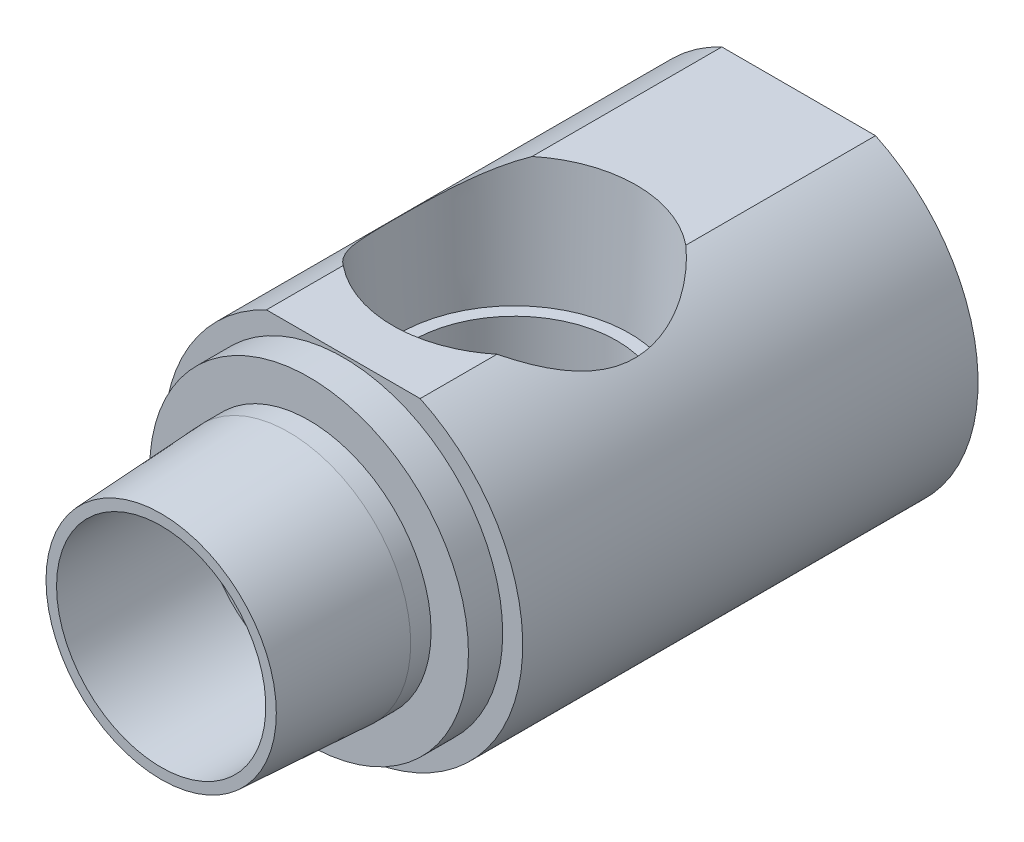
ISO-10303-21;
HEADER;
FILE_DESCRIPTION(('STEP AP214'),'2;1');
FILE_NAME('part.step','',(''),(''),'','','');
FILE_SCHEMA(('AUTOMOTIVE_DESIGN { 1 0 10303 214 1 1 1 1 }'));
ENDSEC;
DATA;
#1=APPLICATION_CONTEXT('core data for automotive mechanical design processes');
#2=APPLICATION_PROTOCOL_DEFINITION('international standard','automotive_design',2000,#1);
#3=PRODUCT_CONTEXT('',#1,'mechanical');
#4=PRODUCT('Part','Part','',(#3));
#5=PRODUCT_RELATED_PRODUCT_CATEGORY('part','',(#4));
#6=PRODUCT_DEFINITION_FORMATION('','',#4);
#7=PRODUCT_DEFINITION_CONTEXT('part definition',#1,'design');
#8=PRODUCT_DEFINITION('design','',#6,#7);
#9=PRODUCT_DEFINITION_SHAPE('','',#8);
#10=(LENGTH_UNIT() NAMED_UNIT(*) SI_UNIT(.MILLI.,.METRE.));
#11=(NAMED_UNIT(*) PLANE_ANGLE_UNIT() SI_UNIT($,.RADIAN.));
#12=(NAMED_UNIT(*) SI_UNIT($,.STERADIAN.) SOLID_ANGLE_UNIT());
#13=UNCERTAINTY_MEASURE_WITH_UNIT(LENGTH_MEASURE(1.E-05),#10,'distance_accuracy_value','');
#14=(GEOMETRIC_REPRESENTATION_CONTEXT(3) GLOBAL_UNCERTAINTY_ASSIGNED_CONTEXT((#13)) GLOBAL_UNIT_ASSIGNED_CONTEXT((#10,
#11,#12)) REPRESENTATION_CONTEXT('',''));
#15=CARTESIAN_POINT('',(0.,0.,0.));
#16=DIRECTION('',(0.,0.,1.));
#17=DIRECTION('',(1.,0.,0.));
#18=AXIS2_PLACEMENT_3D('',#15,#16,#17);
#19=CARTESIAN_POINT('',(-5.3594,11.3032925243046,0.));
#20=DIRECTION('',(0.,-1.,0.));
#21=DIRECTION('',(0.,0.,-1.));
#22=AXIS2_PLACEMENT_3D('',#19,#20,#21);
#23=PLANE('',#22);
#24=DIRECTION('',(0.,0.,-1.));
#25=VECTOR('',#24,1.);
#26=CARTESIAN_POINT('',(5.3594,11.3032925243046,0.));
#27=LINE('',#26,#25);
#28=CARTESIAN_POINT('',(5.3594,11.3032925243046,-12.7));
#29=VERTEX_POINT('',#28);
#30=CARTESIAN_POINT('',(5.3594,11.3032925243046,-18.05323946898));
#31=VERTEX_POINT('',#30);
#32=EDGE_CURVE('E142',#29,#31,#27,.T.);
#33=ORIENTED_EDGE('',*,*,#32,.T.);
#34=CARTESIAN_POINT('',(0.,11.3032925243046,-24.638));
#35=DIRECTION('',(0.,-1.,0.));
#36=DIRECTION('',(0.,0.,-1.));
#37=AXIS2_PLACEMENT_3D('',#34,#35,#36);
#38=CIRCLE('',#37,8.49012600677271);
#39=CARTESIAN_POINT('',(-5.3594,11.3032925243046,-18.05323946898));
#40=VERTEX_POINT('',#39);
#41=EDGE_CURVE('E128',#31,#40,#38,.T.);
#42=ORIENTED_EDGE('',*,*,#41,.T.);
#43=DIRECTION('',(0.,0.,-1.));
#44=VECTOR('',#43,1.);
#45=CARTESIAN_POINT('',(-5.3594,11.3032925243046,0.));
#46=LINE('',#45,#44);
#47=CARTESIAN_POINT('',(-5.3594,11.3032925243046,-12.7));
#48=VERTEX_POINT('',#47);
#49=EDGE_CURVE('E152',#48,#40,#46,.T.);
#50=ORIENTED_EDGE('',*,*,#49,.F.);
#51=DIRECTION('',(1.,0.,0.));
#52=VECTOR('',#51,1.);
#53=CARTESIAN_POINT('',(-11.1125,11.3032925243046,-12.7));
#54=LINE('',#53,#52);
#55=EDGE_CURVE('E149',#48,#29,#54,.T.);
#56=ORIENTED_EDGE('',*,*,#55,.T.);
#57=EDGE_LOOP('',(#33,#42,#50,#56));
#58=FACE_BOUND('',#57,.T.);
#59=ADVANCED_FACE('F16',(#58),#23,.F.);
#60=CARTESIAN_POINT('',(0.,0.,-75.1971669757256));
#61=DIRECTION('',(0.,0.,-1.));
#62=DIRECTION('',(-1.,0.,0.));
#63=AXIS2_PLACEMENT_3D('',#60,#61,#62);
#64=CYLINDRICAL_SURFACE('',#63,7.29488);
#65=CARTESIAN_POINT('',(0.,0.,0.));
#66=DIRECTION('',(0.,0.,-1.));
#67=DIRECTION('',(-1.,0.,0.));
#68=AXIS2_PLACEMENT_3D('',#65,#66,#67);
#69=CIRCLE('',#68,7.29488);
#70=CARTESIAN_POINT('',(-7.29488,0.,0.));
#71=VERTEX_POINT('',#70);
#72=EDGE_CURVE('E177',#71,#71,#69,.T.);
#73=ORIENTED_EDGE('',*,*,#72,.F.);
#74=EDGE_LOOP('',(#73));
#75=FACE_BOUND('',#74,.T.);
#76=CARTESIAN_POINT('',(0.,0.,-10.16));
#77=DIRECTION('',(0.,0.,-1.));
#78=DIRECTION('',(-1.,0.,0.));
#79=AXIS2_PLACEMENT_3D('',#76,#77,#78);
#80=CIRCLE('',#79,7.29488);
#81=CARTESIAN_POINT('',(-2.83926860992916,-6.71965981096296,-10.16));
#82=VERTEX_POINT('',#81);
#83=CARTESIAN_POINT('',(2.83926860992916,-6.71965981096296,-10.16));
#84=VERTEX_POINT('',#83);
#85=EDGE_CURVE('E174',#82,#84,#80,.T.);
#86=ORIENTED_EDGE('',*,*,#85,.T.);
#87=CARTESIAN_POINT('',(2.83926860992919,-6.71965981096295,-10.16));
#88=CARTESIAN_POINT('',(2.70908587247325,-6.77470567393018,-10.1020217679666));
#89=CARTESIAN_POINT('',(2.5754535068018,-6.82667201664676,-10.0489157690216));
#90=CARTESIAN_POINT('',(2.30236644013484,-6.92352687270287,-9.95216490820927));
#91=CARTESIAN_POINT('',(2.16291320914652,-6.96841715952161,-9.90851767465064));
#92=CARTESIAN_POINT('',(1.87942013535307,-7.05016472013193,-9.83043423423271));
#93=CARTESIAN_POINT('',(1.73538792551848,-7.08703463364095,-9.79598351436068));
#94=CARTESIAN_POINT('',(1.44358277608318,-7.15218030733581,-9.73591827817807));
#95=CARTESIAN_POINT('',(1.2958096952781,-7.18045574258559,-9.71030409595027));
#96=CARTESIAN_POINT('',(0.997667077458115,-7.22791200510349,-9.66769273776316));
#97=CARTESIAN_POINT('',(0.847298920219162,-7.2470975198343,-9.65069112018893));
#98=CARTESIAN_POINT('',(0.544945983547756,-7.27608226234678,-9.62512012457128));
#99=CARTESIAN_POINT('',(0.392961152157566,-7.28588118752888,-9.61655101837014));
#100=CARTESIAN_POINT('',(0.0883390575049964,-7.29593786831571,-9.60775748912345));
#101=CARTESIAN_POINT('',(-0.0642985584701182,-7.29618956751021,-9.60753836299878));
#102=CARTESIAN_POINT('',(-0.369068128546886,-7.28713276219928,-9.61545583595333));
#103=CARTESIAN_POINT('',(-0.521200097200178,-7.27782453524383,-9.62359219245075));
#104=CARTESIAN_POINT('',(-0.825795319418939,-7.24962203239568,-9.6484560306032));
#105=CARTESIAN_POINT('',(-0.978239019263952,-7.23060958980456,-9.66528944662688));
#106=CARTESIAN_POINT('',(-1.28042184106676,-7.18325692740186,-9.70777205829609));
#107=CARTESIAN_POINT('',(-1.43016107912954,-7.15491710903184,-9.73342087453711));
#108=CARTESIAN_POINT('',(-1.72558403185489,-7.08946317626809,-9.79372044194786));
#109=CARTESIAN_POINT('',(-1.87127414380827,-7.05236389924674,-9.82835598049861));
#110=CARTESIAN_POINT('',(-2.15770494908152,-6.97006186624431,-9.90692525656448));
#111=CARTESIAN_POINT('',(-2.29844851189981,-6.92486390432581,-9.95085349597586));
#112=CARTESIAN_POINT('',(-2.50498218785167,-6.85169148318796,-10.023911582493));
#113=CARTESIAN_POINT('',(-2.57303323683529,-6.8264174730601,-10.049445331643));
#114=CARTESIAN_POINT('',(-2.7074313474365,-6.77423657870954,-10.1029103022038));
#115=CARTESIAN_POINT('',(-2.77378053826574,-6.74733189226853,-10.1308383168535));
#116=CARTESIAN_POINT('',(-2.83926860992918,-6.7196598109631,-10.1600000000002));
#117=B_SPLINE_CURVE_WITH_KNOTS('',3,(#87,#88,#89,#90,#91,#92,#93,#94,#95,#96,#97,#98,#99,#100,
#101,#102,#103,#104,#105,#106,#107,#108,#109,#110,#111,#112,#113,#114,#115,#116),.UNSPECIFIED.,
.F.,.F.,(4,2,2,2,2,2,2,2,2,2,2,2,2,2,4),(0.,0.458141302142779,0.916167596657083,
1.37346674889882,1.83078318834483,2.28786354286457,2.74495863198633,3.20234368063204,
3.65971545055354,4.12279436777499,4.58585335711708,5.04813354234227,5.51014097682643,
5.74093493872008,5.9714244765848),.UNSPECIFIED.);
#118=EDGE_CURVE('E238',#84,#82,#117,.T.);
#119=ORIENTED_EDGE('',*,*,#118,.T.);
#120=EDGE_LOOP('',(#86,#119));
#121=FACE_BOUND('',#120,.T.);
#122=ADVANCED_FACE('F232',(#75,#121),#64,.F.);
#123=CARTESIAN_POINT('',(-7.29488,0.,-10.16));
#124=DIRECTION('',(0.,0.,1.));
#125=DIRECTION('',(1.,0.,0.));
#126=AXIS2_PLACEMENT_3D('',#123,#124,#125);
#127=PLANE('',#126);
#128=ORIENTED_EDGE('',*,*,#85,.F.);
#129=CARTESIAN_POINT('',(0.,-0.996470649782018,-10.16));
#130=DIRECTION('',(0.,0.,1.));
#131=DIRECTION('',(0.,-1.,0.));
#132=AXIS2_PLACEMENT_3D('',#129,#130,#131);
#133=ELLIPSE('',#132,6.41876281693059,6.27107494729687);
#134=EDGE_CURVE('E184',#82,#84,#133,.F.);
#135=ORIENTED_EDGE('',*,*,#134,.T.);
#136=EDGE_LOOP('',(#128,#135));
#137=FACE_BOUND('',#136,.T.);
#138=ADVANCED_FACE('F229',(#137),#127,.T.);
#139=CARTESIAN_POINT('',(0.,0.,-8.89));
#140=DIRECTION('',(0.,0.,-1.));
#141=DIRECTION('',(-1.,0.,0.));
#142=AXIS2_PLACEMENT_3D('',#139,#140,#141);
#143=CONICAL_SURFACE('',#142,8.509,0.0538619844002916);
#144=CARTESIAN_POINT('',(0.,0.,0.));
#145=DIRECTION('',(0.,0.,-1.));
#146=DIRECTION('',(-1.,0.,0.));
#147=AXIS2_PLACEMENT_3D('',#144,#145,#146);
#148=CIRCLE('',#147,8.02970337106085);
#149=CARTESIAN_POINT('',(-8.02970337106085,0.,0.));
#150=VERTEX_POINT('',#149);
#151=EDGE_CURVE('E180',#150,#150,#148,.T.);
#152=ORIENTED_EDGE('',*,*,#151,.T.);
#153=EDGE_LOOP('',(#152));
#154=FACE_BOUND('',#153,.T.);
#155=CARTESIAN_POINT('',(0.,0.,-8.89));
#156=DIRECTION('',(0.,0.,-1.));
#157=DIRECTION('',(-1.,0.,0.));
#158=AXIS2_PLACEMENT_3D('',#155,#156,#157);
#159=CIRCLE('',#158,8.509);
#160=CARTESIAN_POINT('',(-8.509,0.,-8.89));
#161=VERTEX_POINT('',#160);
#162=EDGE_CURVE('E157',#161,#161,#159,.T.);
#163=ORIENTED_EDGE('',*,*,#162,.F.);
#164=EDGE_LOOP('',(#163));
#165=FACE_BOUND('',#164,.T.);
#166=ADVANCED_FACE('F18',(#154,#165),#143,.T.);
#167=CARTESIAN_POINT('',(-7.29488,0.,0.));
#168=DIRECTION('',(0.,0.,1.));
#169=DIRECTION('',(1.,0.,0.));
#170=AXIS2_PLACEMENT_3D('',#167,#168,#169);
#171=PLANE('',#170);
#172=ORIENTED_EDGE('',*,*,#72,.T.);
#173=EDGE_LOOP('',(#172));
#174=FACE_BOUND('',#173,.T.);
#175=ORIENTED_EDGE('',*,*,#151,.F.);
#176=EDGE_LOOP('',(#175));
#177=FACE_BOUND('',#176,.T.);
#178=ADVANCED_FACE('F227',(#174,#177),#171,.T.);
#179=CARTESIAN_POINT('',(-12.5095,0.,-44.45));
#180=DIRECTION('',(0.,0.,-1.));
#181=DIRECTION('',(-1.,0.,0.));
#182=AXIS2_PLACEMENT_3D('',#179,#180,#181);
#183=PLANE('',#182);
#184=DIRECTION('',(1.,0.,0.));
#185=VECTOR('',#184,1.);
#186=CARTESIAN_POINT('',(-3.66617420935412,6.35,-44.45));
#187=LINE('',#186,#185);
#188=CARTESIAN_POINT('',(-3.66617420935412,6.35,-44.45));
#189=VERTEX_POINT('',#188);
#190=CARTESIAN_POINT('',(3.66617420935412,6.35,-44.45));
#191=VERTEX_POINT('',#190);
#192=EDGE_CURVE('E245',#189,#191,#187,.T.);
#193=ORIENTED_EDGE('',*,*,#192,.F.);
#194=DIRECTION('',(0.5,0.866025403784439,0.));
#195=VECTOR('',#194,1.);
#196=CARTESIAN_POINT('',(-7.33234841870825,0.,-44.45));
#197=LINE('',#196,#195);
#198=CARTESIAN_POINT('',(-7.33234841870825,0.,-44.45));
#199=VERTEX_POINT('',#198);
#200=EDGE_CURVE('E252',#199,#189,#197,.T.);
#201=ORIENTED_EDGE('',*,*,#200,.F.);
#202=DIRECTION('',(-0.5,0.866025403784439,0.));
#203=VECTOR('',#202,1.);
#204=CARTESIAN_POINT('',(-3.66617420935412,-6.35,-44.45));
#205=LINE('',#204,#203);
#206=CARTESIAN_POINT('',(-3.66617420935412,-6.35,-44.45));
#207=VERTEX_POINT('',#206);
#208=EDGE_CURVE('E278',#207,#199,#205,.T.);
#209=ORIENTED_EDGE('',*,*,#208,.F.);
#210=DIRECTION('',(-1.,0.,0.));
#211=VECTOR('',#210,1.);
#212=CARTESIAN_POINT('',(3.66617420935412,-6.35,-44.45));
#213=LINE('',#212,#211);
#214=CARTESIAN_POINT('',(3.66617420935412,-6.35,-44.45));
#215=VERTEX_POINT('',#214);
#216=EDGE_CURVE('E275',#215,#207,#213,.T.);
#217=ORIENTED_EDGE('',*,*,#216,.F.);
#218=DIRECTION('',(-0.5,-0.866025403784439,0.));
#219=VECTOR('',#218,1.);
#220=CARTESIAN_POINT('',(7.33234841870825,0.,-44.45));
#221=LINE('',#220,#219);
#222=CARTESIAN_POINT('',(7.33234841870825,0.,-44.45));
#223=VERTEX_POINT('',#222);
#224=EDGE_CURVE('E272',#223,#215,#221,.T.);
#225=ORIENTED_EDGE('',*,*,#224,.F.);
#226=DIRECTION('',(0.5,-0.866025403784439,0.));
#227=VECTOR('',#226,1.);
#228=CARTESIAN_POINT('',(3.66617420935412,6.35,-44.45));
#229=LINE('',#228,#227);
#230=EDGE_CURVE('E269',#191,#223,#229,.T.);
#231=ORIENTED_EDGE('',*,*,#230,.F.);
#232=EDGE_LOOP('',(#193,#201,#209,#217,#225,#231));
#233=FACE_BOUND('',#232,.T.);
#234=DIRECTION('',(-1.,0.,0.));
#235=VECTOR('',#234,1.);
#236=CARTESIAN_POINT('',(-5.3594,11.3032925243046,-44.45));
#237=LINE('',#236,#235);
#238=CARTESIAN_POINT('',(5.3594,11.3032925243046,-44.45));
#239=VERTEX_POINT('',#238);
#240=CARTESIAN_POINT('',(-5.3594,11.3032925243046,-44.45));
#241=VERTEX_POINT('',#240);
#242=EDGE_CURVE('E154',#239,#241,#237,.T.);
#243=ORIENTED_EDGE('',*,*,#242,.F.);
#244=CARTESIAN_POINT('',(0.,0.,-44.45));
#245=DIRECTION('',(0.,0.,-1.));
#246=DIRECTION('',(-1.,0.,0.));
#247=AXIS2_PLACEMENT_3D('',#244,#245,#246);
#248=CIRCLE('',#247,12.5095);
#249=EDGE_CURVE('E171',#239,#241,#248,.T.);
#250=ORIENTED_EDGE('',*,*,#249,.T.);
#251=EDGE_LOOP('',(#243,#250));
#252=FACE_BOUND('',#251,.T.);
#253=ADVANCED_FACE('F222',(#233,#252),#183,.T.);
#254=CARTESIAN_POINT('',(0.,0.,-75.1971669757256));
#255=DIRECTION('',(0.,0.,-1.));
#256=DIRECTION('',(-1.,0.,0.));
#257=AXIS2_PLACEMENT_3D('',#254,#255,#256);
#258=CYLINDRICAL_SURFACE('',#257,12.5095);
#259=CARTESIAN_POINT('',(5.3589781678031,11.3034925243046,-18.0528826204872));
#260=CARTESIAN_POINT('',(5.54921369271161,11.2133234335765,-18.2138407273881));
#261=CARTESIAN_POINT('',(5.73165431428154,11.1209258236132,-18.382665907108));
#262=CARTESIAN_POINT('',(6.08048620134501,10.9340894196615,-18.7352208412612));
#263=CARTESIAN_POINT('',(6.24687354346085,10.8396501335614,-18.9189542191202));
#264=CARTESIAN_POINT('',(6.56420314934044,10.6505028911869,-19.3018126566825));
#265=CARTESIAN_POINT('',(6.71502345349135,10.5557980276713,-19.5010405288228));
#266=CARTESIAN_POINT('',(6.99914257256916,10.3695935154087,-19.9128637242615));
#267=CARTESIAN_POINT('',(7.1324444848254,10.2780933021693,-20.1254566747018));
#268=CARTESIAN_POINT('',(7.46650834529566,10.0401700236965,-20.7146742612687));
#269=CARTESIAN_POINT('',(7.65054804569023,9.89929381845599,-21.1034819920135));
#270=CARTESIAN_POINT('',(7.88323238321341,9.71350267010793,-21.7099632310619));
#271=CARTESIAN_POINT('',(7.95350713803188,9.65587918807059,-21.9157452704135));
#272=CARTESIAN_POINT('',(8.07900681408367,9.55112103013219,-22.3345154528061));
#273=CARTESIAN_POINT('',(8.1342346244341,9.50398434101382,-22.5475022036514));
#274=CARTESIAN_POINT('',(8.22106638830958,9.42891275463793,-22.944107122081));
#275=CARTESIAN_POINT('',(8.25505388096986,9.39910020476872,-23.1268521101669));
#276=CARTESIAN_POINT('',(8.31144289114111,9.34927427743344,-23.4954304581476));
#277=CARTESIAN_POINT('',(8.33384667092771,9.32925898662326,-23.6812632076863));
#278=CARTESIAN_POINT('',(8.36672861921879,9.29978140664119,-24.0547275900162));
#279=CARTESIAN_POINT('',(8.37721265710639,9.29031392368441,-24.2423582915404));
#280=CARTESIAN_POINT('',(8.3861052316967,9.28228778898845,-24.6181465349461));
#281=CARTESIAN_POINT('',(8.38451351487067,9.28372936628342,-24.8063040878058));
#282=CARTESIAN_POINT('',(8.36928475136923,9.29746017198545,-25.1816139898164));
#283=CARTESIAN_POINT('',(8.35565497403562,9.30974285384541,-25.3687668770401));
#284=CARTESIAN_POINT('',(8.3165791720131,9.3446659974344,-25.7408437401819));
#285=CARTESIAN_POINT('',(8.2911332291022,9.36730638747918,-25.925767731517));
#286=CARTESIAN_POINT('',(8.22876601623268,9.42213985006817,-26.292394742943));
#287=CARTESIAN_POINT('',(8.19183425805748,9.45434165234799,-26.4740946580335));
#288=CARTESIAN_POINT('',(8.10694730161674,9.52723048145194,-26.8332473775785));
#289=CARTESIAN_POINT('',(8.0589858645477,9.56792230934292,-27.0106977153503));
#290=CARTESIAN_POINT('',(7.93720028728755,9.66935365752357,-27.4109579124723));
#291=CARTESIAN_POINT('',(7.85990590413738,9.73249157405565,-27.6321095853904));
#292=CARTESIAN_POINT('',(7.68886075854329,9.86817719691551,-28.0649768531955));
#293=CARTESIAN_POINT('',(7.59510436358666,9.940728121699,-28.2766891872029));
#294=CARTESIAN_POINT('',(7.39186656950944,10.092770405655,-28.6902308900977));
#295=CARTESIAN_POINT('',(7.28236248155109,10.172271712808,-28.8920454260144));
#296=CARTESIAN_POINT('',(7.04849385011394,10.3357003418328,-29.2848508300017));
#297=CARTESIAN_POINT('',(6.92413202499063,10.4196268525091,-29.4758436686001));
#298=CARTESIAN_POINT('',(6.58695562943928,10.637641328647,-29.9510218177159));
#299=CARTESIAN_POINT('',(6.36373226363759,10.7733928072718,-30.2272036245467));
#300=CARTESIAN_POINT('',(6.00459360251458,10.9750283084,-30.6184604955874));
#301=CARTESIAN_POINT('',(5.88113847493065,11.0417585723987,-30.7447819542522));
#302=CARTESIAN_POINT('',(5.62611191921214,11.1738564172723,-30.9897690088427));
#303=CARTESIAN_POINT('',(5.49453878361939,11.2392237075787,-31.1084329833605));
#304=CARTESIAN_POINT('',(5.3589781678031,11.3034925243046,-31.2231173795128));
#305=B_SPLINE_CURVE_WITH_KNOTS('',3,(#259,#260,#261,#262,#263,#264,#265,#266,#267,#268,#269,
#270,#271,#272,#273,#274,#275,#276,#277,#278,#279,#280,#281,#282,#283,#284,#285,#286,#287,#288,
#289,#290,#291,#292,#293,#294,#295,#296,#297,#298,#299,#300,#301,#302,#303,#304),.UNSPECIFIED.,
.F.,.F.,(4,2,2,2,2,2,2,2,2,2,2,2,2,2,2,2,2,2,2,2,2,2,4),(0.,0.79468460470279,1.58956293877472,
2.39025916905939,3.19081364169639,4.54240556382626,5.21661127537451,5.89068744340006,
6.45486541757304,7.01893316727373,7.58272304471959,8.14652475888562,8.70998624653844,
9.27344383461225,9.83741745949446,10.4017108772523,11.1285534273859,11.8556451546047,
12.5837951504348,13.3118121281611,14.4492964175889,15.0154674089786,15.5817578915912),.UNSPECIFIED.);
#306=CARTESIAN_POINT('',(5.3594,11.3032925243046,-31.2227605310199));
#307=VERTEX_POINT('',#306);
#308=EDGE_CURVE('E36',#31,#307,#305,.T.);
#309=ORIENTED_EDGE('',*,*,#308,.F.);
#310=ORIENTED_EDGE('',*,*,#32,.F.);
#311=CARTESIAN_POINT('',(0.,0.,-12.7));
#312=DIRECTION('',(0.,0.,-1.));
#313=DIRECTION('',(-1.,0.,0.));
#314=AXIS2_PLACEMENT_3D('',#311,#312,#313);
#315=CIRCLE('',#314,12.5095);
#316=EDGE_CURVE('E169',#29,#48,#315,.T.);
#317=ORIENTED_EDGE('',*,*,#316,.T.);
#318=ORIENTED_EDGE('',*,*,#49,.T.);
#319=CARTESIAN_POINT('',(-5.3589781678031,11.3034925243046,-31.2231173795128));
#320=CARTESIAN_POINT('',(-5.54921369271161,11.2133234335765,-31.0621592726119));
#321=CARTESIAN_POINT('',(-5.73165431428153,11.1209258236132,-30.893334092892));
#322=CARTESIAN_POINT('',(-6.08048620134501,10.9340894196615,-30.5407791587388));
#323=CARTESIAN_POINT('',(-6.24687354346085,10.8396501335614,-30.3570457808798));
#324=CARTESIAN_POINT('',(-6.56420314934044,10.6505028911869,-29.9741873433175));
#325=CARTESIAN_POINT('',(-6.71502345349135,10.5557980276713,-29.7749594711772));
#326=CARTESIAN_POINT('',(-6.99914257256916,10.3695935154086,-29.3631362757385));
#327=CARTESIAN_POINT('',(-7.1324444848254,10.2780933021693,-29.1505433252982));
#328=CARTESIAN_POINT('',(-7.46650834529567,10.0401700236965,-28.5613257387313));
#329=CARTESIAN_POINT('',(-7.65054804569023,9.89929381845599,-28.1725180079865));
#330=CARTESIAN_POINT('',(-7.88323238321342,9.71350267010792,-27.5660367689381));
#331=CARTESIAN_POINT('',(-7.95350713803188,9.65587918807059,-27.3602547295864));
#332=CARTESIAN_POINT('',(-8.07900681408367,9.55112103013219,-26.9414845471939));
#333=CARTESIAN_POINT('',(-8.1342346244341,9.50398434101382,-26.7284977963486));
#334=CARTESIAN_POINT('',(-8.22106638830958,9.42891275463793,-26.331892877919));
#335=CARTESIAN_POINT('',(-8.25505388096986,9.39910020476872,-26.1491478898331));
#336=CARTESIAN_POINT('',(-8.31144289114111,9.34927427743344,-25.7805695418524));
#337=CARTESIAN_POINT('',(-8.33384667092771,9.32925898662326,-25.5947367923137));
#338=CARTESIAN_POINT('',(-8.36672861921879,9.29978140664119,-25.2212724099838));
#339=CARTESIAN_POINT('',(-8.37721265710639,9.29031392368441,-25.0336417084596));
#340=CARTESIAN_POINT('',(-8.3861052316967,9.28228778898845,-24.6578534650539));
#341=CARTESIAN_POINT('',(-8.38451351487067,9.28372936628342,-24.4696959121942));
#342=CARTESIAN_POINT('',(-8.36928475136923,9.29746017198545,-24.0943860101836));
#343=CARTESIAN_POINT('',(-8.35565497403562,9.30974285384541,-23.9072331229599));
#344=CARTESIAN_POINT('',(-8.3165791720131,9.3446659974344,-23.5351562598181));
#345=CARTESIAN_POINT('',(-8.2911332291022,9.36730638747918,-23.350232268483));
#346=CARTESIAN_POINT('',(-8.22876601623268,9.42213985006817,-22.983605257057));
#347=CARTESIAN_POINT('',(-8.19183425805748,9.45434165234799,-22.8019053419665));
#348=CARTESIAN_POINT('',(-8.10694730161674,9.52723048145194,-22.4427526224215));
#349=CARTESIAN_POINT('',(-8.0589858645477,9.56792230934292,-22.2653022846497));
#350=CARTESIAN_POINT('',(-7.93720028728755,9.66935365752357,-21.8650420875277));
#351=CARTESIAN_POINT('',(-7.85990590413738,9.73249157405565,-21.6438904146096));
#352=CARTESIAN_POINT('',(-7.68886075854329,9.86817719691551,-21.2110231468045));
#353=CARTESIAN_POINT('',(-7.59510436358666,9.940728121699,-20.9993108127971));
#354=CARTESIAN_POINT('',(-7.39186656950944,10.092770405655,-20.5857691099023));
#355=CARTESIAN_POINT('',(-7.28236248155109,10.172271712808,-20.3839545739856));
#356=CARTESIAN_POINT('',(-7.04849385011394,10.3357003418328,-19.9911491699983));
#357=CARTESIAN_POINT('',(-6.92413202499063,10.4196268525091,-19.8001563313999));
#358=CARTESIAN_POINT('',(-6.58695562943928,10.637641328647,-19.3249781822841));
#359=CARTESIAN_POINT('',(-6.36373226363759,10.7733928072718,-19.0487963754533));
#360=CARTESIAN_POINT('',(-6.00459360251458,10.9750283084,-18.6575395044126));
#361=CARTESIAN_POINT('',(-5.88113847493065,11.0417585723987,-18.5312180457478));
#362=CARTESIAN_POINT('',(-5.62611191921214,11.1738564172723,-18.2862309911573));
#363=CARTESIAN_POINT('',(-5.49453878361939,11.2392237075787,-18.1675670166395));
#364=CARTESIAN_POINT('',(-5.3589781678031,11.3034925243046,-18.0528826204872));
#365=B_SPLINE_CURVE_WITH_KNOTS('',3,(#319,#320,#321,#322,#323,#324,#325,#326,#327,#328,#329,
#330,#331,#332,#333,#334,#335,#336,#337,#338,#339,#340,#341,#342,#343,#344,#345,#346,#347,#348,
#349,#350,#351,#352,#353,#354,#355,#356,#357,#358,#359,#360,#361,#362,#363,#364),.UNSPECIFIED.,
.F.,.F.,(4,2,2,2,2,2,2,2,2,2,2,2,2,2,2,2,2,2,2,2,2,2,4),(0.,0.794684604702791,1.58956293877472,
2.39025916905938,3.19081364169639,4.54240556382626,5.21661127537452,5.89068744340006,
6.45486541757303,7.01893316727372,7.58272304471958,8.14652475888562,8.70998624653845,
9.27344383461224,9.83741745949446,10.4017108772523,11.1285534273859,11.8556451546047,
12.5837951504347,13.3118121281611,14.4492964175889,15.0154674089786,15.5817578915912),.UNSPECIFIED.);
#366=CARTESIAN_POINT('',(-5.3594,11.3032925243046,-31.2227605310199));
#367=VERTEX_POINT('',#366);
#368=EDGE_CURVE('E131',#367,#40,#365,.T.);
#369=ORIENTED_EDGE('',*,*,#368,.F.);
#370=EDGE_CURVE('E150',#367,#241,#46,.T.);
#371=ORIENTED_EDGE('',*,*,#370,.T.);
#372=ORIENTED_EDGE('',*,*,#249,.F.);
#373=EDGE_CURVE('E145',#307,#239,#27,.T.);
#374=ORIENTED_EDGE('',*,*,#373,.F.);
#375=EDGE_LOOP('',(#309,#310,#317,#318,#369,#371,#372,#374));
#376=FACE_BOUND('',#375,.T.);
#377=ADVANCED_FACE('F140',(#376),#258,.T.);
#378=CARTESIAN_POINT('',(-11.1125,0.,-12.7));
#379=DIRECTION('',(0.,0.,1.));
#380=DIRECTION('',(1.,0.,0.));
#381=AXIS2_PLACEMENT_3D('',#378,#379,#380);
#382=PLANE('',#381);
#383=ORIENTED_EDGE('',*,*,#55,.F.);
#384=ORIENTED_EDGE('',*,*,#316,.F.);
#385=EDGE_LOOP('',(#383,#384));
#386=FACE_BOUND('',#385,.T.);
#387=CARTESIAN_POINT('',(0.,0.,-12.7));
#388=DIRECTION('',(0.,0.,-1.));
#389=DIRECTION('',(-1.,0.,0.));
#390=AXIS2_PLACEMENT_3D('',#387,#388,#389);
#391=CIRCLE('',#390,11.1125);
#392=CARTESIAN_POINT('',(-11.1125,0.,-12.7));
#393=VERTEX_POINT('',#392);
#394=EDGE_CURVE('E166',#393,#393,#391,.T.);
#395=ORIENTED_EDGE('',*,*,#394,.T.);
#396=EDGE_LOOP('',(#395));
#397=FACE_BOUND('',#396,.T.);
#398=ADVANCED_FACE('F221',(#386,#397),#382,.T.);
#399=CARTESIAN_POINT('',(0.,0.,-75.1971669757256));
#400=DIRECTION('',(0.,0.,-1.));
#401=DIRECTION('',(-1.,0.,0.));
#402=AXIS2_PLACEMENT_3D('',#399,#400,#401);
#403=CYLINDRICAL_SURFACE('',#402,11.1125);
#404=CARTESIAN_POINT('',(0.,0.,-10.3124));
#405=DIRECTION('',(0.,0.,-1.));
#406=DIRECTION('',(-1.,0.,0.));
#407=AXIS2_PLACEMENT_3D('',#404,#405,#406);
#408=CIRCLE('',#407,11.1125);
#409=CARTESIAN_POINT('',(-11.1125,0.,-10.3124));
#410=VERTEX_POINT('',#409);
#411=EDGE_CURVE('E163',#410,#410,#408,.T.);
#412=ORIENTED_EDGE('',*,*,#411,.T.);
#413=EDGE_LOOP('',(#412));
#414=FACE_BOUND('',#413,.T.);
#415=ORIENTED_EDGE('',*,*,#394,.F.);
#416=EDGE_LOOP('',(#415));
#417=FACE_BOUND('',#416,.T.);
#418=ADVANCED_FACE('F303',(#414,#417),#403,.T.);
#419=CARTESIAN_POINT('',(-8.509,0.,-10.3124));
#420=DIRECTION('',(0.,0.,1.));
#421=DIRECTION('',(1.,0.,0.));
#422=AXIS2_PLACEMENT_3D('',#419,#420,#421);
#423=PLANE('',#422);
#424=CARTESIAN_POINT('',(0.,0.,-10.3124));
#425=DIRECTION('',(0.,0.,-1.));
#426=DIRECTION('',(-1.,0.,0.));
#427=AXIS2_PLACEMENT_3D('',#424,#425,#426);
#428=CIRCLE('',#427,8.509);
#429=CARTESIAN_POINT('',(-8.509,0.,-10.3124));
#430=VERTEX_POINT('',#429);
#431=EDGE_CURVE('E160',#430,#430,#428,.T.);
#432=ORIENTED_EDGE('',*,*,#431,.T.);
#433=EDGE_LOOP('',(#432));
#434=FACE_BOUND('',#433,.T.);
#435=ORIENTED_EDGE('',*,*,#411,.F.);
#436=EDGE_LOOP('',(#435));
#437=FACE_BOUND('',#436,.T.);
#438=ADVANCED_FACE('F307',(#434,#437),#423,.T.);
#439=CARTESIAN_POINT('',(0.,0.,-75.1971669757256));
#440=DIRECTION('',(0.,0.,-1.));
#441=DIRECTION('',(-1.,0.,0.));
#442=AXIS2_PLACEMENT_3D('',#439,#440,#441);
#443=CYLINDRICAL_SURFACE('',#442,8.509);
#444=ORIENTED_EDGE('',*,*,#162,.T.);
#445=EDGE_LOOP('',(#444));
#446=FACE_BOUND('',#445,.T.);
#447=ORIENTED_EDGE('',*,*,#431,.F.);
#448=EDGE_LOOP('',(#447));
#449=FACE_BOUND('',#448,.T.);
#450=ADVANCED_FACE('F314',(#446,#449),#443,.T.);
#451=ORIENTED_EDGE('',*,*,#370,.F.);
#452=EDGE_CURVE('E135',#367,#307,#38,.T.);
#453=ORIENTED_EDGE('',*,*,#452,.T.);
#454=ORIENTED_EDGE('',*,*,#373,.T.);
#455=ORIENTED_EDGE('',*,*,#242,.T.);
#456=EDGE_LOOP('',(#451,#453,#454,#455));
#457=FACE_BOUND('',#456,.T.);
#458=ADVANCED_FACE('F298',(#457),#23,.F.);
#459=CARTESIAN_POINT('',(-3.66617420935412,6.35,-38.1));
#460=DIRECTION('',(0.,1.,0.));
#461=DIRECTION('',(-1.,0.,0.));
#462=AXIS2_PLACEMENT_3D('',#459,#460,#461);
#463=PLANE('',#462);
#464=ORIENTED_EDGE('',*,*,#192,.T.);
#465=DIRECTION('',(0.,0.,-1.));
#466=VECTOR('',#465,1.);
#467=CARTESIAN_POINT('',(3.66617420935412,6.35,-38.1));
#468=LINE('',#467,#466);
#469=CARTESIAN_POINT('',(3.66617420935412,6.35,-38.1));
#470=VERTEX_POINT('',#469);
#471=EDGE_CURVE('E267',#470,#191,#468,.T.);
#472=ORIENTED_EDGE('',*,*,#471,.F.);
#473=DIRECTION('',(1.,0.,0.));
#474=VECTOR('',#473,1.);
#475=CARTESIAN_POINT('',(-3.66617420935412,6.35,-38.1));
#476=LINE('',#475,#474);
#477=CARTESIAN_POINT('',(-3.66617420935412,6.35,-38.1));
#478=VERTEX_POINT('',#477);
#479=EDGE_CURVE('E248',#478,#470,#476,.T.);
#480=ORIENTED_EDGE('',*,*,#479,.F.);
#481=DIRECTION('',(0.,0.,-1.));
#482=VECTOR('',#481,1.);
#483=CARTESIAN_POINT('',(-3.66617420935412,6.35,-38.1));
#484=LINE('',#483,#482);
#485=EDGE_CURVE('E283',#478,#189,#484,.T.);
#486=ORIENTED_EDGE('',*,*,#485,.T.);
#487=EDGE_LOOP('',(#464,#472,#480,#486));
#488=FACE_BOUND('',#487,.T.);
#489=ADVANCED_FACE('F325',(#488),#463,.F.);
#490=CARTESIAN_POINT('',(-7.33234841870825,0.,-38.1));
#491=DIRECTION('',(-0.866025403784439,0.5,0.));
#492=DIRECTION('',(-0.5,-0.866025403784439,0.));
#493=AXIS2_PLACEMENT_3D('',#490,#491,#492);
#494=PLANE('',#493);
#495=ORIENTED_EDGE('',*,*,#200,.T.);
#496=ORIENTED_EDGE('',*,*,#485,.F.);
#497=DIRECTION('',(0.5,0.866025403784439,0.));
#498=VECTOR('',#497,1.);
#499=CARTESIAN_POINT('',(-7.33234841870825,0.,-38.1));
#500=LINE('',#499,#498);
#501=CARTESIAN_POINT('',(-7.33234841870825,0.,-38.1));
#502=VERTEX_POINT('',#501);
#503=EDGE_CURVE('E264',#502,#478,#500,.T.);
#504=ORIENTED_EDGE('',*,*,#503,.F.);
#505=DIRECTION('',(0.,0.,-1.));
#506=VECTOR('',#505,1.);
#507=CARTESIAN_POINT('',(-7.33234841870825,0.,-38.1));
#508=LINE('',#507,#506);
#509=EDGE_CURVE('E285',#502,#199,#508,.T.);
#510=ORIENTED_EDGE('',*,*,#509,.T.);
#511=EDGE_LOOP('',(#495,#496,#504,#510));
#512=FACE_BOUND('',#511,.T.);
#513=ADVANCED_FACE('F331',(#512),#494,.F.);
#514=CARTESIAN_POINT('',(-3.66617420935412,-6.35,-38.1));
#515=DIRECTION('',(-0.866025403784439,-0.5,0.));
#516=DIRECTION('',(0.5,-0.866025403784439,0.));
#517=AXIS2_PLACEMENT_3D('',#514,#515,#516);
#518=PLANE('',#517);
#519=ORIENTED_EDGE('',*,*,#208,.T.);
#520=ORIENTED_EDGE('',*,*,#509,.F.);
#521=DIRECTION('',(-0.5,0.866025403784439,0.));
#522=VECTOR('',#521,1.);
#523=CARTESIAN_POINT('',(-3.66617420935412,-6.35,-38.1));
#524=LINE('',#523,#522);
#525=CARTESIAN_POINT('',(-3.66617420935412,-6.35,-38.1));
#526=VERTEX_POINT('',#525);
#527=EDGE_CURVE('E261',#526,#502,#524,.T.);
#528=ORIENTED_EDGE('',*,*,#527,.F.);
#529=DIRECTION('',(0.,0.,-1.));
#530=VECTOR('',#529,1.);
#531=CARTESIAN_POINT('',(-3.66617420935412,-6.35,-38.1));
#532=LINE('',#531,#530);
#533=EDGE_CURVE('E287',#526,#207,#532,.T.);
#534=ORIENTED_EDGE('',*,*,#533,.T.);
#535=EDGE_LOOP('',(#519,#520,#528,#534));
#536=FACE_BOUND('',#535,.T.);
#537=ADVANCED_FACE('F500',(#536),#518,.F.);
#538=CARTESIAN_POINT('',(3.66617420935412,-6.35,-38.1));
#539=DIRECTION('',(0.,-1.,0.));
#540=DIRECTION('',(1.,0.,0.));
#541=AXIS2_PLACEMENT_3D('',#538,#539,#540);
#542=PLANE('',#541);
#543=ORIENTED_EDGE('',*,*,#216,.T.);
#544=ORIENTED_EDGE('',*,*,#533,.F.);
#545=DIRECTION('',(-1.,0.,0.));
#546=VECTOR('',#545,1.);
#547=CARTESIAN_POINT('',(3.66617420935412,-6.35,-38.1));
#548=LINE('',#547,#546);
#549=CARTESIAN_POINT('',(3.66617420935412,-6.35,-38.1));
#550=VERTEX_POINT('',#549);
#551=EDGE_CURVE('E258',#550,#526,#548,.T.);
#552=ORIENTED_EDGE('',*,*,#551,.F.);
#553=DIRECTION('',(0.,0.,-1.));
#554=VECTOR('',#553,1.);
#555=CARTESIAN_POINT('',(3.66617420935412,-6.35,-38.1));
#556=LINE('',#555,#554);
#557=EDGE_CURVE('E289',#550,#215,#556,.T.);
#558=ORIENTED_EDGE('',*,*,#557,.T.);
#559=EDGE_LOOP('',(#543,#544,#552,#558));
#560=FACE_BOUND('',#559,.T.);
#561=ADVANCED_FACE('F511',(#560),#542,.F.);
#562=CARTESIAN_POINT('',(7.33234841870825,0.,-38.1));
#563=DIRECTION('',(0.866025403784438,-0.5,0.));
#564=DIRECTION('',(0.5,0.866025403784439,0.));
#565=AXIS2_PLACEMENT_3D('',#562,#563,#564);
#566=PLANE('',#565);
#567=ORIENTED_EDGE('',*,*,#224,.T.);
#568=ORIENTED_EDGE('',*,*,#557,.F.);
#569=DIRECTION('',(-0.5,-0.866025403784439,0.));
#570=VECTOR('',#569,1.);
#571=CARTESIAN_POINT('',(7.33234841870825,0.,-38.1));
#572=LINE('',#571,#570);
#573=CARTESIAN_POINT('',(7.33234841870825,0.,-38.1));
#574=VERTEX_POINT('',#573);
#575=EDGE_CURVE('E255',#574,#550,#572,.T.);
#576=ORIENTED_EDGE('',*,*,#575,.F.);
#577=DIRECTION('',(0.,0.,-1.));
#578=VECTOR('',#577,1.);
#579=CARTESIAN_POINT('',(7.33234841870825,0.,-38.1));
#580=LINE('',#579,#578);
#581=EDGE_CURVE('E291',#574,#223,#580,.T.);
#582=ORIENTED_EDGE('',*,*,#581,.T.);
#583=EDGE_LOOP('',(#567,#568,#576,#582));
#584=FACE_BOUND('',#583,.T.);
#585=ADVANCED_FACE('F521',(#584),#566,.F.);
#586=CARTESIAN_POINT('',(3.66617420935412,6.35,-38.1));
#587=DIRECTION('',(0.866025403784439,0.5,0.));
#588=DIRECTION('',(-0.5,0.866025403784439,0.));
#589=AXIS2_PLACEMENT_3D('',#586,#587,#588);
#590=PLANE('',#589);
#591=ORIENTED_EDGE('',*,*,#230,.T.);
#592=ORIENTED_EDGE('',*,*,#581,.F.);
#593=DIRECTION('',(0.5,-0.866025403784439,0.));
#594=VECTOR('',#593,1.);
#595=CARTESIAN_POINT('',(3.66617420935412,6.35,-38.1));
#596=LINE('',#595,#594);
#597=EDGE_CURVE('E251',#470,#574,#596,.T.);
#598=ORIENTED_EDGE('',*,*,#597,.F.);
#599=ORIENTED_EDGE('',*,*,#471,.T.);
#600=EDGE_LOOP('',(#591,#592,#598,#599));
#601=FACE_BOUND('',#600,.T.);
#602=ADVANCED_FACE('F489',(#601),#590,.F.);
#603=CARTESIAN_POINT('',(0.,0.,-38.1));
#604=DIRECTION('',(0.,0.,-1.));
#605=DIRECTION('',(-1.,0.,0.));
#606=AXIS2_PLACEMENT_3D('',#603,#604,#605);
#607=PLANE('',#606);
#608=ORIENTED_EDGE('',*,*,#479,.T.);
#609=ORIENTED_EDGE('',*,*,#597,.T.);
#610=ORIENTED_EDGE('',*,*,#575,.T.);
#611=ORIENTED_EDGE('',*,*,#551,.T.);
#612=ORIENTED_EDGE('',*,*,#527,.T.);
#613=ORIENTED_EDGE('',*,*,#503,.T.);
#614=EDGE_LOOP('',(#608,#609,#610,#611,#612,#613));
#615=FACE_BOUND('',#614,.T.);
#616=ADVANCED_FACE('F370',(#615),#607,.T.);
#617=CARTESIAN_POINT('',(0.,-4.02688128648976,-24.0417118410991));
#618=DIRECTION('',(0.,0.213279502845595,0.976991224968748));
#619=DIRECTION('',(0.,-0.976991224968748,0.213279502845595));
#620=AXIS2_PLACEMENT_3D('',#617,#618,#619);
#621=CONICAL_SURFACE('',#620,6.27107494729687,0.738529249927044);
#622=CARTESIAN_POINT('',(0.,-7.8171617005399,-26.7511650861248));
#623=CARTESIAN_POINT('',(0.0306488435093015,-7.81716198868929,-26.7511654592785));
#624=CARTESIAN_POINT('',(0.0612977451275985,-7.81694149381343,-26.7508798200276));
#625=CARTESIAN_POINT('',(0.1297667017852,-7.81595747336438,-26.749605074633));
#626=CARTESIAN_POINT('',(0.167582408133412,-7.81507869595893,-26.7484666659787));
#627=CARTESIAN_POINT('',(0.243722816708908,-7.81263621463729,-26.745302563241));
#628=CARTESIAN_POINT('',(0.282046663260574,-7.81106245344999,-26.743263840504));
#629=CARTESIAN_POINT('',(0.338345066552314,-7.80824831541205,-26.7396182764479));
#630=CARTESIAN_POINT('',(0.356356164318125,-7.80727222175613,-26.7383537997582));
#631=CARTESIAN_POINT('',(0.446379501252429,-7.8020163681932,-26.7315451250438));
#632=CARTESIAN_POINT('',(0.51822164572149,-7.7966139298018,-26.7245465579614));
#633=CARTESIAN_POINT('',(0.733733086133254,-7.77685263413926,-26.6989468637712));
#634=CARTESIAN_POINT('',(0.876563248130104,-7.75896145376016,-26.6757697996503));
#635=CARTESIAN_POINT('',(1.15867598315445,-7.71482779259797,-26.6185970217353));
#636=CARTESIAN_POINT('',(1.29795748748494,-7.68858282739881,-26.5845980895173));
#637=CARTESIAN_POINT('',(1.61886317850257,-7.61887623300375,-26.4942969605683));
#638=CARTESIAN_POINT('',(1.79884032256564,-7.57259419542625,-26.4343410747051));
#639=CARTESIAN_POINT('',(2.15114857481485,-7.4701105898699,-26.3015790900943));
#640=CARTESIAN_POINT('',(2.32347015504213,-7.41389707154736,-26.2287575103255));
#641=CARTESIAN_POINT('',(2.66304496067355,-7.29317142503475,-26.0723639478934));
#642=CARTESIAN_POINT('',(2.83020459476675,-7.22856193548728,-25.9886658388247));
#643=CARTESIAN_POINT('',(3.07597005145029,-7.12727098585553,-25.857448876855));
#644=CARTESIAN_POINT('',(3.15704408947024,-7.09278664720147,-25.812776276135));
#645=CARTESIAN_POINT('',(3.31767893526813,-7.02252656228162,-25.7217581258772));
#646=CARTESIAN_POINT('',(3.39723977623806,-6.98675084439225,-25.6754126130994));
#647=CARTESIAN_POINT('',(3.62832422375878,-6.88026489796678,-25.5374658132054));
#648=CARTESIAN_POINT('',(3.77794772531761,-6.80801352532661,-25.4438680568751));
#649=CARTESIAN_POINT('',(4.07276390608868,-6.66019905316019,-25.2523823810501));
#650=CARTESIAN_POINT('',(4.21795568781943,-6.58463529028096,-25.1544936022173));
#651=CARTESIAN_POINT('',(4.50463813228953,-6.43081711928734,-24.9552304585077));
#652=CARTESIAN_POINT('',(4.64612614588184,-6.35256087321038,-24.8538537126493));
#653=CARTESIAN_POINT('',(4.92585635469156,-6.19390612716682,-24.6483250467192));
#654=CARTESIAN_POINT('',(5.06409831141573,-6.11350747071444,-24.5441729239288));
#655=CARTESIAN_POINT('',(5.33830269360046,-5.95065173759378,-24.3332021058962));
#656=CARTESIAN_POINT('',(5.47425459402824,-5.86818805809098,-24.2263748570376));
#657=CARTESIAN_POINT('',(5.74373112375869,-5.70179106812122,-24.0108165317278));
#658=CARTESIAN_POINT('',(5.8772556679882,-5.61785770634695,-23.9020853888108));
#659=CARTESIAN_POINT('',(6.27471014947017,-5.36420563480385,-23.5734928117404));
#660=CARTESIAN_POINT('',(6.53550012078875,-5.19264744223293,-23.3512484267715));
#661=CARTESIAN_POINT('',(6.90967614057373,-4.94086927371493,-23.0250833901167));
#662=CARTESIAN_POINT('',(7.02561522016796,-4.86205133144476,-22.9229789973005));
#663=CARTESIAN_POINT('',(7.25630735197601,-4.70377895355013,-22.7179456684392));
#664=CARTESIAN_POINT('',(7.37106048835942,-4.62432456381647,-22.615016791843));
#665=CARTESIAN_POINT('',(7.71377734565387,-4.38509712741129,-22.3051105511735));
#666=CARTESIAN_POINT('',(7.94016627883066,-4.22448159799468,-22.097041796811));
#667=CARTESIAN_POINT('',(8.38754778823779,-3.90293226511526,-21.6804919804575));
#668=CARTESIAN_POINT('',(8.6085704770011,-3.74201405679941,-21.4720311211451));
#669=CARTESIAN_POINT('',(9.04780163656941,-3.41880327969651,-21.0533289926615));
#670=CARTESIAN_POINT('',(9.2660106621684,-3.25651099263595,-20.8430880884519));
#671=CARTESIAN_POINT('',(9.48311661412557,-3.09367537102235,-20.6321433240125));
#672=B_SPLINE_CURVE_WITH_KNOTS('',3,(#622,#623,#624,#625,#626,#627,#628,#629,#630,#631,#632,
#633,#634,#635,#636,#637,#638,#639,#640,#641,#642,#643,#644,#645,#646,#647,#648,#649,#650,#651,
#652,#653,#654,#655,#656,#657,#658,#659,#660,#661,#662,#663,#664,#665,#666,#667,#668,#669,#670,
#671),.UNSPECIFIED.,.F.,.F.,(4,2,2,2,2,2,2,2,2,2,2,2,2,2,2,2,2,2,2,2,2,2,2,2,4),(0.,
0.0919447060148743,0.205458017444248,0.320670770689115,0.374915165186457,0.591966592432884,
1.02853093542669,1.46522523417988,2.04991564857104,2.6353144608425,3.22823618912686,
3.52455545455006,3.82086821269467,4.39280368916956,4.96485423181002,5.53730333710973,
6.10979437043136,6.68443789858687,7.25910152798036,8.40851631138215,8.92881630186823,
9.44907910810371,10.4897488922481,11.5211435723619,12.5523316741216),.UNSPECIFIED.);
#673=CARTESIAN_POINT('',(0.,-7.8171617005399,-26.7511650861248));
#674=VERTEX_POINT('',#673);
#675=CARTESIAN_POINT('',(6.0919781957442,-5.48065691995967,-23.7243491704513));
#676=VERTEX_POINT('',#675);
#677=EDGE_CURVE('E383',#674,#676,#672,.T.);
#678=ORIENTED_EDGE('',*,*,#677,.F.);
#679=CARTESIAN_POINT('',(0.,-7.8171617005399,-26.7511650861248));
#680=CARTESIAN_POINT('',(-0.0306488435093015,-7.81716198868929,-26.7511654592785));
#681=CARTESIAN_POINT('',(-0.0612977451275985,-7.81694149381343,-26.7508798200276));
#682=CARTESIAN_POINT('',(-0.1297667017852,-7.81595747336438,-26.749605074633));
#683=CARTESIAN_POINT('',(-0.167582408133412,-7.81507869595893,-26.7484666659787));
#684=CARTESIAN_POINT('',(-0.243722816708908,-7.81263621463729,-26.745302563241));
#685=CARTESIAN_POINT('',(-0.282046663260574,-7.81106245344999,-26.743263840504));
#686=CARTESIAN_POINT('',(-0.338345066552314,-7.80824831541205,-26.7396182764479));
#687=CARTESIAN_POINT('',(-0.356356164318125,-7.80727222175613,-26.7383537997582));
#688=CARTESIAN_POINT('',(-0.446379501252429,-7.8020163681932,-26.7315451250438));
#689=CARTESIAN_POINT('',(-0.51822164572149,-7.7966139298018,-26.7245465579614));
#690=CARTESIAN_POINT('',(-0.733733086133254,-7.77685263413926,-26.6989468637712));
#691=CARTESIAN_POINT('',(-0.876563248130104,-7.75896145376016,-26.6757697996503));
#692=CARTESIAN_POINT('',(-1.15867598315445,-7.71482779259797,-26.6185970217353));
#693=CARTESIAN_POINT('',(-1.29795748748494,-7.68858282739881,-26.5845980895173));
#694=CARTESIAN_POINT('',(-1.61886317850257,-7.61887623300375,-26.4942969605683));
#695=CARTESIAN_POINT('',(-1.79884032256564,-7.57259419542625,-26.4343410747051));
#696=CARTESIAN_POINT('',(-2.15114857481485,-7.4701105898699,-26.3015790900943));
#697=CARTESIAN_POINT('',(-2.32347015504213,-7.41389707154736,-26.2287575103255));
#698=CARTESIAN_POINT('',(-2.66304496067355,-7.29317142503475,-26.0723639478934));
#699=CARTESIAN_POINT('',(-2.83020459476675,-7.22856193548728,-25.9886658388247));
#700=CARTESIAN_POINT('',(-3.07597005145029,-7.12727098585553,-25.857448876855));
#701=CARTESIAN_POINT('',(-3.15704408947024,-7.09278664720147,-25.812776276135));
#702=CARTESIAN_POINT('',(-3.31767893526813,-7.02252656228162,-25.7217581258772));
#703=CARTESIAN_POINT('',(-3.39723977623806,-6.98675084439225,-25.6754126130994));
#704=CARTESIAN_POINT('',(-3.62832422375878,-6.88026489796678,-25.5374658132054));
#705=CARTESIAN_POINT('',(-3.77794772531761,-6.80801352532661,-25.4438680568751));
#706=CARTESIAN_POINT('',(-4.07276390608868,-6.66019905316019,-25.2523823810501));
#707=CARTESIAN_POINT('',(-4.21795568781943,-6.58463529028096,-25.1544936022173));
#708=CARTESIAN_POINT('',(-4.50463813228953,-6.43081711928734,-24.9552304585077));
#709=CARTESIAN_POINT('',(-4.64612614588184,-6.35256087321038,-24.8538537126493));
#710=CARTESIAN_POINT('',(-4.92585635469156,-6.19390612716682,-24.6483250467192));
#711=CARTESIAN_POINT('',(-5.06409831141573,-6.11350747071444,-24.5441729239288));
#712=CARTESIAN_POINT('',(-5.33830269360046,-5.95065173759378,-24.3332021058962));
#713=CARTESIAN_POINT('',(-5.47425459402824,-5.86818805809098,-24.2263748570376));
#714=CARTESIAN_POINT('',(-5.74373112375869,-5.70179106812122,-24.0108165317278));
#715=CARTESIAN_POINT('',(-5.8772556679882,-5.61785770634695,-23.9020853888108));
#716=CARTESIAN_POINT('',(-6.27471014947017,-5.36420563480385,-23.5734928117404));
#717=CARTESIAN_POINT('',(-6.53550012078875,-5.19264744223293,-23.3512484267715));
#718=CARTESIAN_POINT('',(-6.90967614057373,-4.94086927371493,-23.0250833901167));
#719=CARTESIAN_POINT('',(-7.02561522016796,-4.86205133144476,-22.9229789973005));
#720=CARTESIAN_POINT('',(-7.25630735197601,-4.70377895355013,-22.7179456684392));
#721=CARTESIAN_POINT('',(-7.37106048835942,-4.62432456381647,-22.615016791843));
#722=CARTESIAN_POINT('',(-7.71377734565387,-4.38509712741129,-22.3051105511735));
#723=CARTESIAN_POINT('',(-7.94016627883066,-4.22448159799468,-22.097041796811));
#724=CARTESIAN_POINT('',(-8.38754778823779,-3.90293226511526,-21.6804919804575));
#725=CARTESIAN_POINT('',(-8.6085704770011,-3.74201405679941,-21.4720311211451));
#726=CARTESIAN_POINT('',(-9.04780163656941,-3.41880327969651,-21.0533289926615));
#727=CARTESIAN_POINT('',(-9.2660106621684,-3.25651099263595,-20.8430880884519));
#728=CARTESIAN_POINT('',(-9.48311661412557,-3.09367537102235,-20.6321433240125));
#729=B_SPLINE_CURVE_WITH_KNOTS('',3,(#679,#680,#681,#682,#683,#684,#685,#686,#687,#688,#689,
#690,#691,#692,#693,#694,#695,#696,#697,#698,#699,#700,#701,#702,#703,#704,#705,#706,#707,#708,
#709,#710,#711,#712,#713,#714,#715,#716,#717,#718,#719,#720,#721,#722,#723,#724,#725,#726,#727,
#728),.UNSPECIFIED.,.F.,.F.,(4,2,2,2,2,2,2,2,2,2,2,2,2,2,2,2,2,2,2,2,2,2,2,2,4),(0.,
0.0919447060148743,0.205458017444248,0.320670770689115,0.374915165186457,0.591966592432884,
1.02853093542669,1.46522523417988,2.04991564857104,2.6353144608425,3.22823618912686,
3.52455545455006,3.82086821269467,4.39280368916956,4.96485423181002,5.53730333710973,
6.10979437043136,6.68443789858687,7.25910152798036,8.40851631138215,8.92881630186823,
9.44907910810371,10.4897488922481,11.5211435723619,12.5523316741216),.UNSPECIFIED.);
#730=CARTESIAN_POINT('',(-6.09197819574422,-5.48065691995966,-23.7243491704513));
#731=VERTEX_POINT('',#730);
#732=EDGE_CURVE('E146',#731,#674,#729,.F.);
#733=ORIENTED_EDGE('',*,*,#732,.F.);
#734=CARTESIAN_POINT('',(0.,-4.02688128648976,-24.0417118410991));
#735=DIRECTION('',(0.,-0.213279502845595,-0.976991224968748));
#736=DIRECTION('',(0.,0.976991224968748,-0.213279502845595));
#737=AXIS2_PLACEMENT_3D('',#734,#735,#736);
#738=CIRCLE('',#737,6.27107494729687);
#739=EDGE_CURVE('E246',#676,#731,#738,.T.);
#740=ORIENTED_EDGE('',*,*,#739,.F.);
#741=EDGE_LOOP('',(#678,#733,#740));
#742=FACE_BOUND('',#741,.T.);
#743=ADVANCED_FACE('F361',(#742),#621,.F.);
#744=CARTESIAN_POINT('',(0.,-5.49601282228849,-30.7715128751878));
#745=DIRECTION('',(0.,-0.213279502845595,-0.976991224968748));
#746=DIRECTION('',(0.,0.976991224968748,-0.213279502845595));
#747=AXIS2_PLACEMENT_3D('',#744,#745,#746);
#748=CYLINDRICAL_SURFACE('',#747,6.27107494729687);
#749=CARTESIAN_POINT('',(6.1733996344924,-5.4473725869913,-25.379403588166));
#750=CARTESIAN_POINT('',(6.16556245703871,-5.4615694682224,-25.2387089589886));
#751=CARTESIAN_POINT('',(6.15770208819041,-5.47308176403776,-25.0977284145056));
#752=CARTESIAN_POINT('',(6.14232757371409,-5.4903692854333,-24.815371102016));
#753=CARTESIAN_POINT('',(6.1348134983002,-5.4961433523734,-24.6739942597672));
#754=CARTESIAN_POINT('',(6.12053666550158,-5.50157705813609,-24.3912552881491));
#755=CARTESIAN_POINT('',(6.11377297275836,-5.50124439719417,-24.249893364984));
#756=CARTESIAN_POINT('',(6.10130458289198,-5.49432900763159,-23.9672962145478));
#757=CARTESIAN_POINT('',(6.09559978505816,-5.48774687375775,-23.8260609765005));
#758=CARTESIAN_POINT('',(6.08061165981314,-5.4588933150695,-23.4071952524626));
#759=CARTESIAN_POINT('',(6.07322064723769,-5.42759803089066,-23.1300732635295));
#760=CARTESIAN_POINT('',(6.0641492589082,-5.34298500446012,-22.5792315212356));
#761=CARTESIAN_POINT('',(6.06246861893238,-5.28966828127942,-22.305511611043));
#762=CARTESIAN_POINT('',(6.06351201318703,-5.20525205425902,-21.9374242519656));
#763=CARTESIAN_POINT('',(6.06409521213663,-5.18198291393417,-21.8411718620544));
#764=CARTESIAN_POINT('',(6.06581815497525,-5.13337299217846,-21.6492146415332));
#765=CARTESIAN_POINT('',(6.06695777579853,-5.10803266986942,-21.5535096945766));
#766=CARTESIAN_POINT('',(6.06974140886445,-5.05531295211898,-21.3620893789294));
#767=CARTESIAN_POINT('',(6.07138824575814,-5.02792280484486,-21.2663770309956));
#768=CARTESIAN_POINT('',(6.07511895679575,-4.97140456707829,-21.0754629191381));
#769=CARTESIAN_POINT('',(6.0772028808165,-4.94227627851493,-20.9802612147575));
#770=CARTESIAN_POINT('',(6.0794725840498,-4.91236883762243,-20.8853125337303));
#771=B_SPLINE_CURVE_WITH_KNOTS('',3,(#749,#750,#751,#752,#753,#754,#755,#756,#757,#758,#759,
#760,#761,#762,#763,#764,#765,#766,#767,#768,#769,#770),.UNSPECIFIED.,.F.,.F.,(4,2,2,2,2,2,2,2,
2,2,4),(0.,0.424876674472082,0.849839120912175,1.27426575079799,1.69865199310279,
2.53445728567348,3.37022390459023,3.66729136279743,3.96429314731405,4.26297977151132,
4.56170049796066),.UNSPECIFIED.);
#772=CARTESIAN_POINT('',(6.07945740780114,-4.91256883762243,-20.8859474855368));
#773=VERTEX_POINT('',#772);
#774=EDGE_CURVE('E10',#676,#773,#771,.T.);
#775=ORIENTED_EDGE('',*,*,#774,.F.);
#776=ORIENTED_EDGE('',*,*,#739,.T.);
#777=CARTESIAN_POINT('',(-6.0794725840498,-4.91236883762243,-20.8853125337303));
#778=CARTESIAN_POINT('',(-6.07573596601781,-4.96156959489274,-21.0415340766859));
#779=CARTESIAN_POINT('',(-6.07250567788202,-5.00867685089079,-21.1984581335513));
#780=CARTESIAN_POINT('',(-6.06733933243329,-5.09790632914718,-21.5138310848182));
#781=CARTESIAN_POINT('',(-6.06540402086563,-5.14002566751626,-21.6722808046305));
#782=CARTESIAN_POINT('',(-6.06311126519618,-5.21852158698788,-21.9910465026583));
#783=CARTESIAN_POINT('',(-6.06275781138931,-5.25488342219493,-22.1513661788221));
#784=CARTESIAN_POINT('',(-6.06387215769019,-5.32085768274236,-22.4733616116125));
#785=CARTESIAN_POINT('',(-6.06533960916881,-5.3504713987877,-22.63503710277));
#786=CARTESIAN_POINT('',(-6.07017346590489,-5.40162696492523,-22.9562006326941));
#787=CARTESIAN_POINT('',(-6.07349982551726,-5.42332359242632,-23.1156644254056));
#788=CARTESIAN_POINT('',(-6.08199666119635,-5.4589193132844,-23.4354291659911));
#789=CARTESIAN_POINT('',(-6.08716726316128,-5.4728178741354,-23.5957301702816));
#790=CARTESIAN_POINT('',(-6.09913989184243,-5.49250235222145,-23.9165225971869));
#791=CARTESIAN_POINT('',(-6.10593942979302,-5.49830055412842,-24.0770133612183));
#792=CARTESIAN_POINT('',(-6.12079517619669,-5.5018556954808,-24.3980021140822));
#793=CARTESIAN_POINT('',(-6.1288511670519,-5.49961402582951,-24.5585000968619));
#794=CARTESIAN_POINT('',(-6.14017047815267,-5.49144391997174,-24.7738735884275));
#795=CARTESIAN_POINT('',(-6.1431078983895,-5.48890223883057,-24.8289128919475));
#796=CARTESIAN_POINT('',(-6.1490461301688,-5.48293652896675,-24.9389390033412));
#797=CARTESIAN_POINT('',(-6.15204693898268,-5.47951253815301,-24.9939258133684));
#798=CARTESIAN_POINT('',(-6.15809935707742,-5.47179157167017,-25.104037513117));
#799=CARTESIAN_POINT('',(-6.16115111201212,-5.46749144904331,-25.1591621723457));
#800=CARTESIAN_POINT('',(-6.16727000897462,-5.45805345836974,-25.2693393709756));
#801=CARTESIAN_POINT('',(-6.17033715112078,-5.45291558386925,-25.3243919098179));
#802=CARTESIAN_POINT('',(-6.1733996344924,-5.4473725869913,-25.379403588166));
#803=B_SPLINE_CURVE_WITH_KNOTS('',3,(#777,#778,#779,#780,#781,#782,#783,#784,#785,#786,#787,
#788,#789,#790,#791,#792,#793,#794,#795,#796,#797,#798,#799,#800,#801,#802),.UNSPECIFIED.,.F.,
.F.,(4,2,2,2,2,2,2,2,2,2,2,2,4),(0.,0.491514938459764,0.983312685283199,1.47635031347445,
1.96929355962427,2.45200558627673,2.93475057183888,3.41676264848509,3.89869134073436,
4.06421563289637,4.22973281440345,4.39585533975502,4.56197914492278),.UNSPECIFIED.);
#804=CARTESIAN_POINT('',(-6.07945740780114,-4.91256883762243,-20.8859474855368));
#805=VERTEX_POINT('',#804);
#806=EDGE_CURVE('E29',#805,#731,#803,.T.);
#807=ORIENTED_EDGE('',*,*,#806,.F.);
#808=CARTESIAN_POINT('',(-3.43816526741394,2.5781,-18.3756745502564));
#809=CARTESIAN_POINT('',(-3.53420964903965,2.50213365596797,-18.428409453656));
#810=CARTESIAN_POINT('',(-3.62756877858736,2.42382017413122,-18.4825369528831));
#811=CARTESIAN_POINT('',(-3.80900853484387,2.26293542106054,-18.5931302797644));
#812=CARTESIAN_POINT('',(-3.89709140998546,2.18036599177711,-18.6495950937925));
#813=CARTESIAN_POINT('',(-4.15335140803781,1.92715515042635,-18.8216726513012));
#814=CARTESIAN_POINT('',(-4.31391172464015,1.75071309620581,-18.9401765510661));
#815=CARTESIAN_POINT('',(-4.61757767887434,1.38252202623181,-19.183276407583));
#816=CARTESIAN_POINT('',(-4.76042428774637,1.1906013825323,-19.3079322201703));
#817=CARTESIAN_POINT('',(-5.02726735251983,0.794965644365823,-19.5588461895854));
#818=CARTESIAN_POINT('',(-5.15125723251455,0.591246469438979,-19.6851048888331));
#819=CARTESIAN_POINT('',(-5.37055249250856,0.191876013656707,-19.92432565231));
#820=CARTESIAN_POINT('',(-5.46744355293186,-0.00281214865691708,-20.0374487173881));
#821=CARTESIAN_POINT('',(-5.64649204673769,-0.401589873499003,-20.2590614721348));
#822=CARTESIAN_POINT('',(-5.72864155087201,-0.605684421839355,-20.3675486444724));
#823=CARTESIAN_POINT('',(-5.87740150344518,-1.02268014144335,-20.5747506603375));
#824=CARTESIAN_POINT('',(-5.94409974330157,-1.23552304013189,-20.6735187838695));
#825=CARTESIAN_POINT('',(-6.06130704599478,-1.6719986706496,-20.8551584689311));
#826=CARTESIAN_POINT('',(-6.11184655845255,-1.8956101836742,-20.9380598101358));
#827=CARTESIAN_POINT('',(-6.18661951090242,-2.31214581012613,-21.0647880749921));
#828=CARTESIAN_POINT('',(-6.21398515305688,-2.50312597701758,-21.1130012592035));
#829=CARTESIAN_POINT('',(-6.25374440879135,-2.89104100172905,-21.1839930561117));
#830=CARTESIAN_POINT('',(-6.26619491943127,-3.08795027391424,-21.2068683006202));
#831=CARTESIAN_POINT('',(-6.27178326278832,-3.38556027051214,-21.2171231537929));
#832=CARTESIAN_POINT('',(-6.27141848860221,-3.48580077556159,-21.2164465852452));
#833=CARTESIAN_POINT('',(-6.2659756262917,-3.68575522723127,-21.2064847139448));
#834=CARTESIAN_POINT('',(-6.26089741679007,-3.78546916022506,-21.1971991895));
#835=CARTESIAN_POINT('',(-6.24590599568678,-3.98355459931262,-21.1700621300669));
#836=CARTESIAN_POINT('',(-6.23598289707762,-4.08192293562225,-21.1521930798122));
#837=CARTESIAN_POINT('',(-6.21135524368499,-4.27622558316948,-21.1084968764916));
#838=CARTESIAN_POINT('',(-6.19665193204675,-4.37216052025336,-21.0826717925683));
#839=CARTESIAN_POINT('',(-6.16585149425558,-4.54317081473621,-21.0295754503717));
#840=CARTESIAN_POINT('',(-6.1505409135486,-4.61876639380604,-21.003496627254));
#841=CARTESIAN_POINT('',(-6.1170900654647,-4.7674707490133,-20.9474755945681));
#842=CARTESIAN_POINT('',(-6.09896284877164,-4.84058918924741,-20.9175513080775));
#843=CARTESIAN_POINT('',(-6.07945740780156,-4.91256883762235,-20.8859474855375));
#844=B_SPLINE_CURVE_WITH_KNOTS('',3,(#808,#809,#810,#811,#812,#813,#814,#815,#816,#817,#818,
#819,#820,#821,#822,#823,#824,#825,#826,#827,#828,#829,#830,#831,#832,#833,#834,#835,#836,#837,
#838,#839,#840,#841,#842,#843),.UNSPECIFIED.,.F.,.F.,(4,2,2,2,2,2,2,2,2,2,2,2,2,2,2,2,2,4),(0.,
0.399852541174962,0.799533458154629,1.59734289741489,2.40570735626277,3.21435307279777,
3.94912566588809,4.68429230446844,5.41517338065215,6.14466894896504,6.73965736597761,
7.33236876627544,7.63267731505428,7.93299359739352,8.23392531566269,8.53477883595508,
8.77886209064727,9.02184639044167),.UNSPECIFIED.);
#845=CARTESIAN_POINT('',(-3.43816526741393,2.5781,-18.3756745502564));
#846=VERTEX_POINT('',#845);
#847=EDGE_CURVE('E401',#846,#805,#844,.T.);
#848=ORIENTED_EDGE('',*,*,#847,.F.);
#849=CARTESIAN_POINT('',(0.,2.5781,6.21440124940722));
#850=DIRECTION('',(0.,-1.,0.));
#851=DIRECTION('',(0.,0.,-1.));
#852=AXIS2_PLACEMENT_3D('',#849,#850,#851);
#853=ELLIPSE('',#852,29.4030831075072,6.27107494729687);
#854=CARTESIAN_POINT('',(-3.70420429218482,2.5781,-17.5111003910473));
#855=VERTEX_POINT('',#854);
#856=EDGE_CURVE('E193',#855,#846,#853,.T.);
#857=ORIENTED_EDGE('',*,*,#856,.F.);
#858=CARTESIAN_POINT('',(3.70443310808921,2.5779,-17.5112311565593));
#859=CARTESIAN_POINT('',(3.5970951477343,2.6717022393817,-17.4498979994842));
#860=CARTESIAN_POINT('',(3.48624807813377,2.76246365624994,-17.390113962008));
#861=CARTESIAN_POINT('',(3.25722442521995,2.93724678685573,-17.274299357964));
#862=CARTESIAN_POINT('',(3.13903756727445,3.02125865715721,-17.2182742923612));
#863=CARTESIAN_POINT('',(2.77171640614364,3.26294533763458,-17.0563063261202));
#864=CARTESIAN_POINT('',(2.51136843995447,3.4088911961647,-16.9573794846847));
#865=CARTESIAN_POINT('',(2.00590411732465,3.64101531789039,-16.7990954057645));
#866=CARTESIAN_POINT('',(1.76465040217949,3.73294421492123,-16.7359858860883));
#867=CARTESIAN_POINT('',(1.3918460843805,3.8448405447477,-16.6589357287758));
#868=CARTESIAN_POINT('',(1.26590096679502,3.87778462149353,-16.6362032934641));
#869=CARTESIAN_POINT('',(1.01102318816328,3.93449294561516,-16.5970260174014));
#870=CARTESIAN_POINT('',(0.88209180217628,3.95826103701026,-16.5805785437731));
#871=CARTESIAN_POINT('',(0.621210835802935,3.99626495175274,-16.5542618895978));
#872=CARTESIAN_POINT('',(0.489246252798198,4.01043128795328,-16.5444406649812));
#873=CARTESIAN_POINT('',(0.224278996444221,4.02864136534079,-16.5318135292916));
#874=CARTESIAN_POINT('',(0.0912763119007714,4.03268499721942,-16.529007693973));
#875=CARTESIAN_POINT('',(-0.174608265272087,4.03055434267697,-16.530485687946));
#876=CARTESIAN_POINT('',(-0.307490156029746,4.02437990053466,-16.5347696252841));
#877=CARTESIAN_POINT('',(-0.57197883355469,4.00195638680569,-16.5503152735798));
#878=CARTESIAN_POINT('',(-0.703585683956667,3.98570782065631,-16.5615766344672));
#879=CARTESIAN_POINT('',(-0.952564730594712,3.94542468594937,-16.5894601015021));
#880=CARTESIAN_POINT('',(-1.07014065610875,3.9222351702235,-16.6054997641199));
#881=CARTESIAN_POINT('',(-1.30270188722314,3.86823414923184,-16.6427932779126));
#882=CARTESIAN_POINT('',(-1.41768640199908,3.83742035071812,-16.6640486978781));
#883=CARTESIAN_POINT('',(-1.75828691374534,3.73411141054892,-16.7351741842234));
#884=CARTESIAN_POINT('',(-1.97917196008,3.65081200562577,-16.7923593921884));
#885=CARTESIAN_POINT('',(-2.4747737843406,3.42843643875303,-16.9441130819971));
#886=CARTESIAN_POINT('',(-2.74340861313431,3.28002750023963,-17.0447910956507));
#887=CARTESIAN_POINT('',(-3.12208662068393,3.03308957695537,-17.2103752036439));
#888=CARTESIAN_POINT('',(-3.24397151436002,2.94698668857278,-17.2678239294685));
#889=CARTESIAN_POINT('',(-3.47994047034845,2.76762000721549,-17.3867169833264));
#890=CARTESIAN_POINT('',(-3.59403717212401,2.67436836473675,-17.4481545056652));
#891=CARTESIAN_POINT('',(-3.70443310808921,2.5779,-17.5112311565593));
#892=B_SPLINE_CURVE_WITH_KNOTS('',3,(#858,#859,#860,#861,#862,#863,#864,#865,#866,#867,#868,
#869,#870,#871,#872,#873,#874,#875,#876,#877,#878,#879,#880,#881,#882,#883,#884,#885,#886,#887,
#888,#889,#890,#891),.UNSPECIFIED.,.F.,.F.,(4,2,2,2,2,2,2,2,2,2,2,2,2,2,2,2,4),(0.,
0.465395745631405,0.931458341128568,1.87031315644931,2.66409541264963,3.06012170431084,
3.45598191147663,3.85467718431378,4.25337676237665,4.65208241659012,5.05076806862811,
5.41310015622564,5.77554135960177,6.50156806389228,7.46553256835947,7.94494386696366,
8.423557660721),.UNSPECIFIED.);
#893=CARTESIAN_POINT('',(3.70420429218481,2.5781,-17.5111003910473));
#894=VERTEX_POINT('',#893);
#895=EDGE_CURVE('E187',#894,#855,#892,.T.);
#896=ORIENTED_EDGE('',*,*,#895,.F.);
#897=CARTESIAN_POINT('',(3.43816526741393,2.5781,-18.3756745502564));
#898=VERTEX_POINT('',#897);
#899=EDGE_CURVE('E408',#898,#894,#853,.T.);
#900=ORIENTED_EDGE('',*,*,#899,.F.);
#901=CARTESIAN_POINT('',(6.07945740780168,-4.91256883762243,-20.8859474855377));
#902=CARTESIAN_POINT('',(6.1055665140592,-4.81628571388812,-20.9282553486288));
#903=CARTESIAN_POINT('',(6.1292001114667,-4.71788768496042,-20.9675365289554));
#904=CARTESIAN_POINT('',(6.17127100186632,-4.51721289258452,-21.0387171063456));
#905=CARTESIAN_POINT('',(6.18969993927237,-4.41493018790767,-21.0706046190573));
#906=CARTESIAN_POINT('',(6.22078607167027,-4.20877254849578,-21.1250960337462));
#907=CARTESIAN_POINT('',(6.23352902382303,-4.10494753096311,-21.1478373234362));
#908=CARTESIAN_POINT('',(6.25351902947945,-3.89521388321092,-21.1837813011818));
#909=CARTESIAN_POINT('',(6.26077029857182,-3.78930691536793,-21.1969913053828));
#910=CARTESIAN_POINT('',(6.26988193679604,-3.57562852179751,-21.2136204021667));
#911=CARTESIAN_POINT('',(6.27169797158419,-3.46784893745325,-21.2169589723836));
#912=CARTESIAN_POINT('',(6.27007497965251,-3.25243674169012,-21.213989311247));
#913=CARTESIAN_POINT('',(6.26663252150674,-3.1448042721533,-21.2076747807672));
#914=CARTESIAN_POINT('',(6.24897707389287,-2.82330740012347,-21.1755363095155));
#915=CARTESIAN_POINT('',(6.22742666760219,-2.61110690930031,-21.1365009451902));
#916=CARTESIAN_POINT('',(6.17571682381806,-2.24792162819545,-21.0463256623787));
#917=CARTESIAN_POINT('',(6.14906219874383,-2.09490854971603,-21.000660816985));
#918=CARTESIAN_POINT('',(6.08782210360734,-1.7938593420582,-20.8990620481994));
#919=CARTESIAN_POINT('',(6.05323128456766,-1.64582664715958,-20.843121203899));
#920=CARTESIAN_POINT('',(5.97667688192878,-1.35399094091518,-20.7236563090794));
#921=CARTESIAN_POINT('',(5.93467802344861,-1.21021219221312,-20.660096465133));
#922=CARTESIAN_POINT('',(5.84384572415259,-0.927238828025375,-20.5278147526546));
#923=CARTESIAN_POINT('',(5.7950100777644,-0.788045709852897,-20.4590912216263));
#924=CARTESIAN_POINT('',(5.65280425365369,-0.414233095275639,-20.2669169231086));
#925=CARTESIAN_POINT('',(5.55288026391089,-0.183853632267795,-20.1400218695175));
#926=CARTESIAN_POINT('',(5.33346573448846,0.265024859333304,-19.8818832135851));
#927=CARTESIAN_POINT('',(5.21396024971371,0.483514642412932,-19.7506363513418));
#928=CARTESIAN_POINT('',(4.95543030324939,0.907202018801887,-19.4887158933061));
#929=CARTESIAN_POINT('',(4.81650190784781,1.11245817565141,-19.3580425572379));
#930=CARTESIAN_POINT('',(4.51780134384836,1.50937282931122,-19.1003059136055));
#931=CARTESIAN_POINT('',(4.35805057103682,1.70104497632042,-18.9732390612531));
#932=CARTESIAN_POINT('',(4.07265974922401,2.00812326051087,-18.7667856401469));
#933=CARTESIAN_POINT('',(3.95308721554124,2.12787528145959,-18.685465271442));
#934=CARTESIAN_POINT('',(3.70351796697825,2.35932971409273,-18.527069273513));
#935=CARTESIAN_POINT('',(3.57351074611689,2.47102379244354,-18.449998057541));
#936=CARTESIAN_POINT('',(3.43816526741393,2.5781,-18.3756745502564));
#937=B_SPLINE_CURVE_WITH_KNOTS('',3,(#901,#902,#903,#904,#905,#906,#907,#908,#909,#910,#911,
#912,#913,#914,#915,#916,#917,#918,#919,#920,#921,#922,#923,#924,#925,#926,#927,#928,#929,#930,
#931,#932,#933,#934,#935,#936),.UNSPECIFIED.,.F.,.F.,(4,2,2,2,2,2,2,2,2,2,2,2,2,2,2,2,2,4),(0.,
0.325146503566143,0.650812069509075,0.971384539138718,1.29171067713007,1.61464263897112,
1.93778541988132,2.58484969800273,3.06995922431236,3.55539667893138,4.04321131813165,
4.53118369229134,5.37412815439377,6.2177189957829,7.05727604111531,7.89597711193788,
8.45876490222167,9.0221266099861),.UNSPECIFIED.);
#938=EDGE_CURVE('E378',#773,#898,#937,.T.);
#939=ORIENTED_EDGE('',*,*,#938,.F.);
#940=EDGE_LOOP('',(#775,#776,#807,#848,#857,#896,#900,#939));
#941=FACE_BOUND('',#940,.T.);
#942=ORIENTED_EDGE('',*,*,#134,.F.);
#943=ORIENTED_EDGE('',*,*,#118,.F.);
#944=EDGE_LOOP('',(#942,#943));
#945=FACE_BOUND('',#944,.T.);
#946=ADVANCED_FACE('F195',(#941,#945),#748,.F.);
#947=CARTESIAN_POINT('',(0.,-9.03719813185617,-24.638));
#948=DIRECTION('',(0.,1.,0.));
#949=DIRECTION('',(0.,0.,1.));
#950=AXIS2_PLACEMENT_3D('',#947,#948,#949);
#951=CONICAL_SURFACE('',#950,0.,1.04719755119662);
#952=ORIENTED_EDGE('',*,*,#774,.T.);
#953=CARTESIAN_POINT('',(0.,-4.91256883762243,-24.638));
#954=DIRECTION('',(0.,-1.,0.));
#955=DIRECTION('',(0.,0.,-1.));
#956=AXIS2_PLACEMENT_3D('',#953,#954,#955);
#957=CIRCLE('',#956,7.14406750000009);
#958=EDGE_CURVE('E211',#805,#773,#957,.T.);
#959=ORIENTED_EDGE('',*,*,#958,.F.);
#960=ORIENTED_EDGE('',*,*,#806,.T.);
#961=ORIENTED_EDGE('',*,*,#732,.T.);
#962=ORIENTED_EDGE('',*,*,#677,.T.);
#963=EDGE_LOOP('',(#952,#959,#960,#961,#962));
#964=FACE_BOUND('',#963,.T.);
#965=ADVANCED_FACE('F360',(#964),#951,.F.);
#966=CARTESIAN_POINT('',(0.,11.3032925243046,-24.638));
#967=DIRECTION('',(0.,-1.,0.));
#968=DIRECTION('',(0.,0.,-1.));
#969=AXIS2_PLACEMENT_3D('',#966,#967,#968);
#970=CYLINDRICAL_SURFACE('',#969,7.14406750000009);
#971=ORIENTED_EDGE('',*,*,#847,.T.);
#972=ORIENTED_EDGE('',*,*,#958,.T.);
#973=ORIENTED_EDGE('',*,*,#938,.T.);
#974=CARTESIAN_POINT('',(0.,2.5781,-24.638));
#975=DIRECTION('',(0.,-1.,0.));
#976=DIRECTION('',(0.,0.,-1.));
#977=AXIS2_PLACEMENT_3D('',#974,#975,#976);
#978=CIRCLE('',#977,7.1440675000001);
#979=EDGE_CURVE('E415',#846,#898,#978,.T.);
#980=ORIENTED_EDGE('',*,*,#979,.F.);
#981=EDGE_LOOP('',(#971,#972,#973,#980));
#982=FACE_BOUND('',#981,.T.);
#983=ADVANCED_FACE('F368',(#982),#970,.F.);
#984=CARTESIAN_POINT('',(0.,2.5781,-32.6700500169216));
#985=DIRECTION('',(0.,-1.,0.));
#986=DIRECTION('',(0.,0.,-1.));
#987=AXIS2_PLACEMENT_3D('',#984,#985,#986);
#988=PLANE('',#987);
#989=ORIENTED_EDGE('',*,*,#899,.T.);
#990=CARTESIAN_POINT('',(0.,2.5781,-24.638));
#991=DIRECTION('',(0.,-1.,0.));
#992=DIRECTION('',(0.,0.,-1.));
#993=AXIS2_PLACEMENT_3D('',#990,#991,#992);
#994=CIRCLE('',#993,8.03205001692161);
#995=EDGE_CURVE('E43',#855,#894,#994,.T.);
#996=ORIENTED_EDGE('',*,*,#995,.F.);
#997=ORIENTED_EDGE('',*,*,#856,.T.);
#998=ORIENTED_EDGE('',*,*,#979,.T.);
#999=EDGE_LOOP('',(#989,#996,#997,#998));
#1000=FACE_BOUND('',#999,.T.);
#1001=ADVANCED_FACE('F201',(#1000),#988,.F.);
#1002=CARTESIAN_POINT('',(0.,2.5781,-24.638));
#1003=DIRECTION('',(0.,1.,0.));
#1004=DIRECTION('',(0.,0.,1.));
#1005=AXIS2_PLACEMENT_3D('',#1002,#1003,#1004);
#1006=CONICAL_SURFACE('',#1005,8.03205001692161,0.0524522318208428);
#1007=ORIENTED_EDGE('',*,*,#308,.T.);
#1008=ORIENTED_EDGE('',*,*,#452,.F.);
#1009=ORIENTED_EDGE('',*,*,#368,.T.);
#1010=ORIENTED_EDGE('',*,*,#41,.F.);
#1011=EDGE_LOOP('',(#1007,#1008,#1009,#1010));
#1012=FACE_BOUND('',#1011,.T.);
#1013=ORIENTED_EDGE('',*,*,#895,.T.);
#1014=ORIENTED_EDGE('',*,*,#995,.T.);
#1015=EDGE_LOOP('',(#1013,#1014));
#1016=FACE_BOUND('',#1015,.T.);
#1017=ADVANCED_FACE('F129',(#1012,#1016),#1006,.F.);
#1018=CLOSED_SHELL('',(#59,#122,#138,#166,#178,#253,#377,#398,#418,#438,#450,#458,#489,#513,
#537,#561,#585,#602,#616,#743,#946,#965,#983,#1001,#1017));
#1019=MANIFOLD_SOLID_BREP('B1',#1018);
#1020=ADVANCED_BREP_SHAPE_REPRESENTATION('',(#18,#1019),#14);
#1021=SHAPE_DEFINITION_REPRESENTATION(#9,#1020);
ENDSEC;
END-ISO-10303-21;
